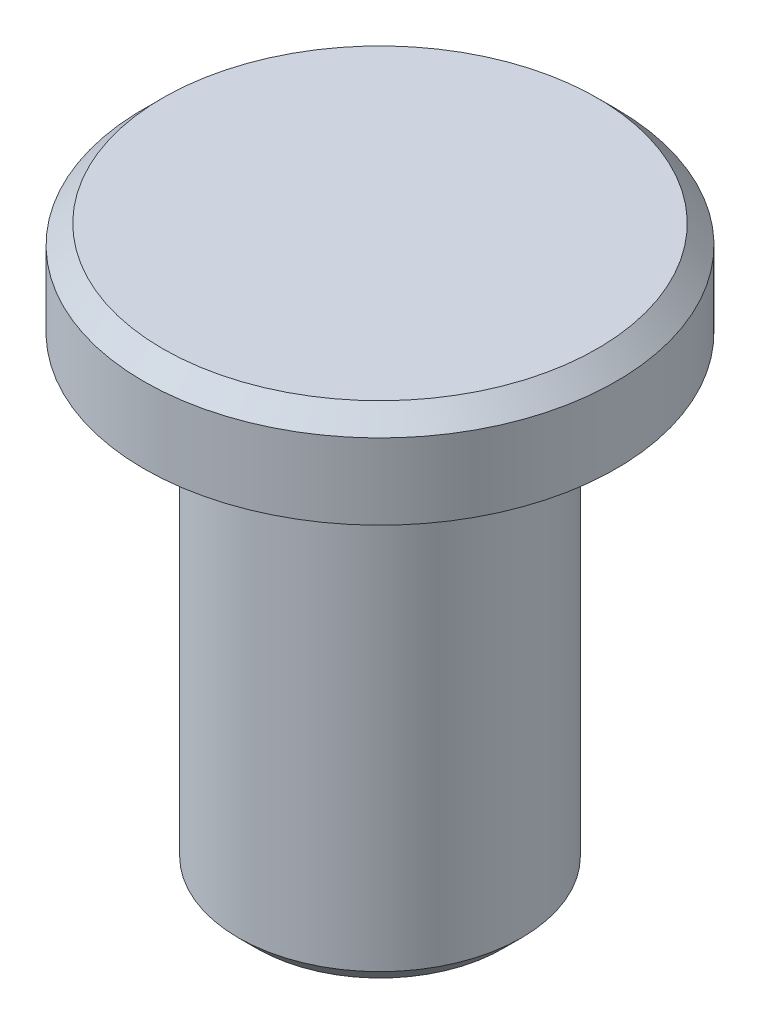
from build123d import *

# Parameters (mm, degrees)
SKETCH1_R           = 1.5
BOSS_EXTRUDE1_DEPTH = 5
SKETCH2_R           = 2.5
BOSS_EXTRUDE2_DEPTH = 1
CHAMFER1_SIZE       = 0.2
CHAMFER2_SIZE       = 0.2


with BuildPart() as part:
    # Sketch1 → Boss-Extrude1 (new body)
    with BuildSketch(Plane(origin=(0, 0, 0), x_dir=(1, 0, 0), z_dir=(0, 1, 0))):
        with Locations(Location((0, 0, 0), (0, 0, 270))):
            Circle(SKETCH1_R)
    extrude(amount=BOSS_EXTRUDE1_DEPTH)

    # Sketch2 → Boss-Extrude2 (add)
    with BuildSketch(Plane(origin=(0, 5, 0), x_dir=(1, 0, 0), z_dir=(0, 1, 0))):
        with Locations(Location((0, 0, 0), (0, 0, 270))):
            Circle(SKETCH2_R)
    extrude(amount=BOSS_EXTRUDE2_DEPTH)

    # Chamfer1
    chamfer1_edges = [part.edges().sort_by_distance(p)[0] for p in [
        (0, 6, -2.5),
    ]]
    chamfer(chamfer1_edges, length=CHAMFER1_SIZE)

    # Chamfer2
    chamfer2_edges = [part.edges().sort_by_distance(p)[0] for p in [
        (0, 0, -1.5),
    ]]
    chamfer(chamfer2_edges, length=CHAMFER2_SIZE)


solid = part.part
